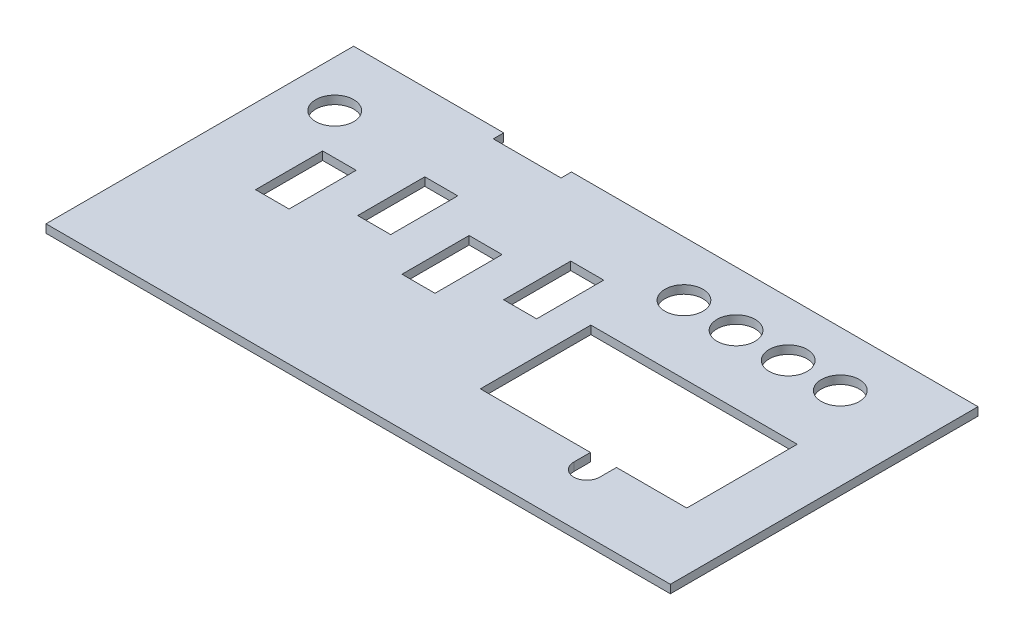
from build123d import *

# Parameters (mm, degrees)
SKETCH1_W           = 150
SKETCH1_H           = 70
BOSS_EXTRUDE1_DEPTH = 1.5875
SKETCH3_OUTSIDE_W   = 185.108
SKETCH3_OUTSIDE_H   = 105.108
CUT_EXTRUDE1_DEPTH  = 10
SKETCH6_R           = 3.65
SKETCH6_R_2         = 3.6
SKETCH6_W           = 39.6
SKETCH6_H           = 21.2
SKETCH6_W_2         = 6.331
SKETCH6_H_2         = 12.87333682
SKETCH6_W_3         = 6.4255
SKETCH6_H_3         = 12.873336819
CUT_EXTRUDE2_DEPTH  = 68.015905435
CUT_EXTRUDE3_DEPTH  = 68.015905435


with BuildPart() as part:
    # Sketch1 → Boss-Extrude1 (new body)
    with BuildSketch(Plane(origin=(0, 0, 0), x_dir=(1, 0, 0), z_dir=(0, 1, 0))):
        Rectangle(SKETCH1_W, SKETCH1_H)
    extrude(amount=BOSS_EXTRUDE1_DEPTH)

    # Sketch3 outside → Cut-Extrude1 (cut)
    with BuildSketch(Plane.XZ):
        Rectangle(SKETCH3_OUTSIDE_W, SKETCH3_OUTSIDE_H)
        Polygon((59.895, -30.02), (59.895, 29), (-59.895, 29), (-59.895, -30.02), (-31.1, -30.02), (-31.1, -28.02), (-18.1, -28.02), (-18.1, -30.02), align=None, mode=Mode.SUBTRACT)
    extrude(amount=-CUT_EXTRUDE1_DEPTH, mode=Mode.SUBTRACT)

    # Sketch6 → Cut-Extrude2 (cut, through all)
    with BuildSketch(Plane(origin=(0, 1.5875, 0), x_dir=(1, 0, 0), z_dir=(0, 1, 0))):
        with Locations(Location((14, 19.5, 0), (0, 0, 270))):
            Circle(SKETCH6_R)
        with Locations((64.495, 5.21)):
            Circle(SKETCH6_R_2)
        with Locations((-64.495, 5.21)):
            Circle(SKETCH6_R_2)
        with Locations(Location((-51, 17.5, 0), (0, 0, 270))):
            Circle(SKETCH6_R)
        with Locations(Location((24, 19.5, 0), (0, 0, 270))):
            Circle(SKETCH6_R)
        with Locations(Location((34, 19.5, 0), (0, 0, 270))):
            Circle(SKETCH6_R)
        with Locations(Location((44, 19.5, 0), (0, 0, 270))):
            Circle(SKETCH6_R)
        with Locations((29, -4.16)):
            Rectangle(SKETCH6_W, SKETCH6_H)
        Polygon((-17.3655, 9.643110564), (-17.3655, -3.230226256), (-11.0345, -3.230226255), (-11.0345, 9.643110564), align=None)
        with Locations((-28.2, 8.706442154)):
            Rectangle(SKETCH6_W_2, SKETCH6_H_2)
        with Locations((-42.24725, 3.206442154)):
            Rectangle(SKETCH6_W_3, SKETCH6_H_2)
        with Locations((-0.2, 8.706442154)):
            Rectangle(SKETCH6_W_2, SKETCH6_H_3)
    extrude(amount=-CUT_EXTRUDE2_DEPTH, mode=Mode.SUBTRACT)

    # Sketch7 → Cut-Extrude3 (cut, through all)
    with BuildSketch(Plane.XZ):
        with BuildLine():
            Line((30.32, 14.76), (35.32, 14.76))
            Line((35.32, 14.76), (35.32, 17.96))
            ThreePointArc((35.32, 17.96), (32.82, 20.46), (30.32, 17.96))
            Line((30.32, 17.96), (30.32, 14.76))
        make_face()
    extrude(amount=-CUT_EXTRUDE3_DEPTH, mode=Mode.SUBTRACT)


solid = part.part
